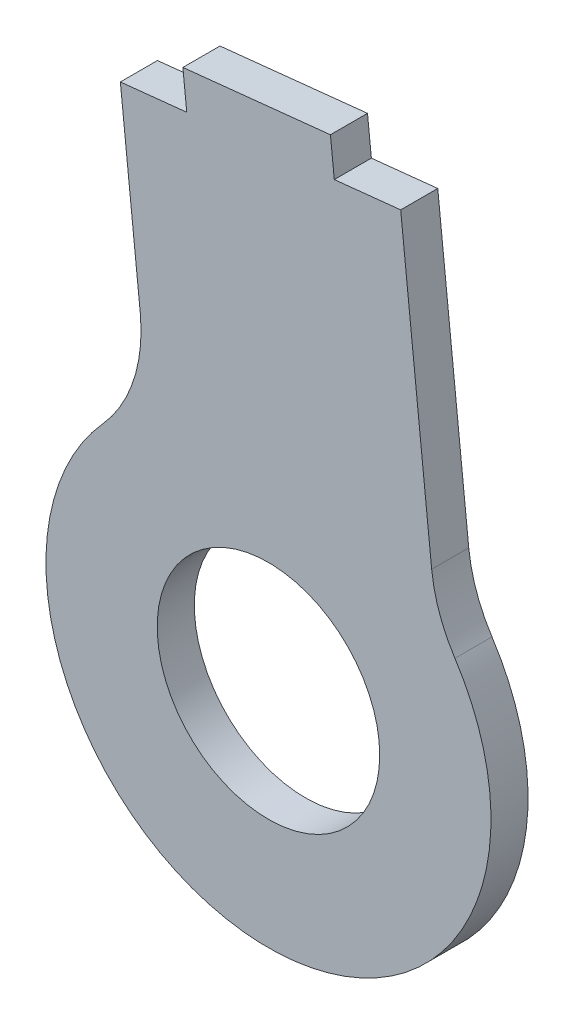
ISO-10303-21;
HEADER;
FILE_DESCRIPTION(('STEP AP214'),'2;1');
FILE_NAME('part.step','',(''),(''),'','','');
FILE_SCHEMA(('AUTOMOTIVE_DESIGN { 1 0 10303 214 1 1 1 1 }'));
ENDSEC;
DATA;
#1=APPLICATION_CONTEXT('core data for automotive mechanical design processes');
#2=APPLICATION_PROTOCOL_DEFINITION('international standard','automotive_design',2000,#1);
#3=PRODUCT_CONTEXT('',#1,'mechanical');
#4=PRODUCT('Part','Part','',(#3));
#5=PRODUCT_RELATED_PRODUCT_CATEGORY('part','',(#4));
#6=PRODUCT_DEFINITION_FORMATION('','',#4);
#7=PRODUCT_DEFINITION_CONTEXT('part definition',#1,'design');
#8=PRODUCT_DEFINITION('design','',#6,#7);
#9=PRODUCT_DEFINITION_SHAPE('','',#8);
#10=(LENGTH_UNIT() NAMED_UNIT(*) SI_UNIT(.MILLI.,.METRE.));
#11=(NAMED_UNIT(*) PLANE_ANGLE_UNIT() SI_UNIT($,.RADIAN.));
#12=(NAMED_UNIT(*) SI_UNIT($,.STERADIAN.) SOLID_ANGLE_UNIT());
#13=UNCERTAINTY_MEASURE_WITH_UNIT(LENGTH_MEASURE(1.E-05),#10,'distance_accuracy_value','');
#14=(GEOMETRIC_REPRESENTATION_CONTEXT(3) GLOBAL_UNCERTAINTY_ASSIGNED_CONTEXT((#13)) GLOBAL_UNIT_ASSIGNED_CONTEXT((#10,
#11,#12)) REPRESENTATION_CONTEXT('',''));
#15=CARTESIAN_POINT('',(0.,0.,0.));
#16=DIRECTION('',(0.,0.,1.));
#17=DIRECTION('',(1.,0.,0.));
#18=AXIS2_PLACEMENT_3D('',#15,#16,#17);
#19=CARTESIAN_POINT('',(42.9472796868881,13.6459324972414,2.5));
#20=DIRECTION('',(0.,0.,1.));
#21=DIRECTION('',(1.,0.,0.));
#22=AXIS2_PLACEMENT_3D('',#19,#20,#21);
#23=PLANE('',#22);
#24=DIRECTION('',(-0.994553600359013,-0.104226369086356,0.));
#25=VECTOR('',#24,1.);
#26=CARTESIAN_POINT('',(16.2310965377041,33.5130367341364,2.5));
#27=LINE('',#26,#25);
#28=CARTESIAN_POINT('',(26.1766325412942,34.555300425,2.5));
#29=VERTEX_POINT('',#28);
#30=CARTESIAN_POINT('',(16.2310965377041,33.5130367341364,2.5));
#31=VERTEX_POINT('',#30);
#32=EDGE_CURVE('E186',#29,#31,#27,.T.);
#33=ORIENTED_EDGE('',*,*,#32,.T.);
#34=DIRECTION('',(0.104226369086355,-0.994553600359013,0.));
#35=VECTOR('',#34,1.);
#36=CARTESIAN_POINT('',(16.49166246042,31.0266527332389,2.5));
#37=LINE('',#36,#35);
#38=CARTESIAN_POINT('',(16.49166246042,31.0266527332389,2.5));
#39=VERTEX_POINT('',#38);
#40=EDGE_CURVE('E110',#31,#39,#37,.T.);
#41=ORIENTED_EDGE('',*,*,#40,.T.);
#42=DIRECTION('',(-0.994553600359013,-0.104226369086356,0.));
#43=VECTOR('',#42,1.);
#44=CARTESIAN_POINT('',(12.0161712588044,30.5576340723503,2.5));
#45=LINE('',#44,#43);
#46=CARTESIAN_POINT('',(12.0161712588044,30.5576340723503,2.5));
#47=VERTEX_POINT('',#46);
#48=EDGE_CURVE('E215',#39,#47,#45,.T.);
#49=ORIENTED_EDGE('',*,*,#48,.T.);
#50=DIRECTION('',(0.104226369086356,-0.994553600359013,0.));
#51=VECTOR('',#50,1.);
#52=CARTESIAN_POINT('',(13.357338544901,17.7598865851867,2.5));
#53=LINE('',#52,#51);
#54=CARTESIAN_POINT('',(13.357338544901,17.7598865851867,2.5));
#55=VERTEX_POINT('',#54);
#56=EDGE_CURVE('E235',#47,#55,#53,.T.);
#57=ORIENTED_EDGE('',*,*,#56,.T.);
#58=CARTESIAN_POINT('',(3.41180254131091,16.7176228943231,2.5));
#59=DIRECTION('',(0.,0.,-1.));
#60=DIRECTION('',(1.,0.,0.));
#61=AXIS2_PLACEMENT_3D('',#58,#59,#60);
#62=CIRCLE('',#61,10.);
#63=CARTESIAN_POINT('',(10.8470815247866,10.0305737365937,2.5));
#64=VERTEX_POINT('',#63);
#65=EDGE_CURVE('E231',#55,#64,#62,.T.);
#66=ORIENTED_EDGE('',*,*,#65,.T.);
#67=CARTESIAN_POINT('',(22.,0.,2.5));
#68=DIRECTION('',(0.,0.,1.));
#69=DIRECTION('',(1.,0.,0.));
#70=AXIS2_PLACEMENT_3D('',#67,#68,#69);
#71=CIRCLE('',#70,15.);
#72=CARTESIAN_POINT('',(34.5683678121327,8.1875594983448,2.5));
#73=VERTEX_POINT('',#72);
#74=EDGE_CURVE('E234',#64,#73,#71,.T.);
#75=ORIENTED_EDGE('',*,*,#74,.T.);
#76=CARTESIAN_POINT('',(42.9472796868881,13.6459324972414,2.5));
#77=DIRECTION('',(0.,0.,-1.));
#78=DIRECTION('',(1.,0.,0.));
#79=AXIS2_PLACEMENT_3D('',#76,#77,#78);
#80=CIRCLE('',#79,10.);
#81=CARTESIAN_POINT('',(33.001743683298,12.6036688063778,2.5));
#82=VERTEX_POINT('',#81);
#83=EDGE_CURVE('E135',#73,#82,#80,.T.);
#84=ORIENTED_EDGE('',*,*,#83,.T.);
#85=DIRECTION('',(-0.104226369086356,0.994553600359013,0.));
#86=VECTOR('',#85,1.);
#87=CARTESIAN_POINT('',(30.9126896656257,32.537935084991,2.5));
#88=LINE('',#87,#86);
#89=CARTESIAN_POINT('',(30.9126896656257,32.537935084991,2.5));
#90=VERTEX_POINT('',#89);
#91=EDGE_CURVE('E129',#82,#90,#88,.T.);
#92=ORIENTED_EDGE('',*,*,#91,.T.);
#93=DIRECTION('',(-0.994553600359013,-0.104226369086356,0.));
#94=VECTOR('',#93,1.);
#95=CARTESIAN_POINT('',(26.4371984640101,32.0689164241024,2.5));
#96=LINE('',#95,#94);
#97=CARTESIAN_POINT('',(26.4371984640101,32.0689164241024,2.5));
#98=VERTEX_POINT('',#97);
#99=EDGE_CURVE('E133',#90,#98,#96,.T.);
#100=ORIENTED_EDGE('',*,*,#99,.T.);
#101=DIRECTION('',(-0.104226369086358,0.994553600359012,0.));
#102=VECTOR('',#101,1.);
#103=CARTESIAN_POINT('',(26.1766325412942,34.555300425,2.5));
#104=LINE('',#103,#102);
#105=EDGE_CURVE('E61',#98,#29,#104,.T.);
#106=ORIENTED_EDGE('',*,*,#105,.T.);
#107=EDGE_LOOP('',(#33,#41,#49,#57,#66,#75,#84,#92,#100,#106));
#108=FACE_BOUND('',#107,.T.);
#109=CARTESIAN_POINT('',(22.,0.,2.5));
#110=DIRECTION('',(0.,0.,1.));
#111=DIRECTION('',(1.,0.,0.));
#112=AXIS2_PLACEMENT_3D('',#109,#110,#111);
#113=CIRCLE('',#112,7.49999999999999);
#114=CARTESIAN_POINT('',(29.5,0.,2.5));
#115=VERTEX_POINT('',#114);
#116=EDGE_CURVE('E162',#115,#115,#113,.T.);
#117=ORIENTED_EDGE('',*,*,#116,.F.);
#118=EDGE_LOOP('',(#117));
#119=FACE_BOUND('',#118,.T.);
#120=ADVANCED_FACE('F43',(#108,#119),#23,.T.);
#121=CARTESIAN_POINT('',(42.9472796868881,13.6459324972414,0.));
#122=DIRECTION('',(0.,0.,1.));
#123=DIRECTION('',(1.,0.,0.));
#124=AXIS2_PLACEMENT_3D('',#121,#122,#123);
#125=PLANE('',#124);
#126=DIRECTION('',(-0.994553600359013,-0.104226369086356,0.));
#127=VECTOR('',#126,1.);
#128=CARTESIAN_POINT('',(16.2310965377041,33.5130367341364,0.));
#129=LINE('',#128,#127);
#130=CARTESIAN_POINT('',(26.1766325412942,34.555300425,0.));
#131=VERTEX_POINT('',#130);
#132=CARTESIAN_POINT('',(16.2310965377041,33.5130367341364,0.));
#133=VERTEX_POINT('',#132);
#134=EDGE_CURVE('E157',#131,#133,#129,.T.);
#135=ORIENTED_EDGE('',*,*,#134,.F.);
#136=DIRECTION('',(-0.104226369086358,0.994553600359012,0.));
#137=VECTOR('',#136,1.);
#138=CARTESIAN_POINT('',(26.1766325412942,34.555300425,0.));
#139=LINE('',#138,#137);
#140=CARTESIAN_POINT('',(26.4371984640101,32.0689164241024,0.));
#141=VERTEX_POINT('',#140);
#142=EDGE_CURVE('E102',#141,#131,#139,.T.);
#143=ORIENTED_EDGE('',*,*,#142,.F.);
#144=DIRECTION('',(-0.994553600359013,-0.104226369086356,0.));
#145=VECTOR('',#144,1.);
#146=CARTESIAN_POINT('',(26.4371984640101,32.0689164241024,0.));
#147=LINE('',#146,#145);
#148=CARTESIAN_POINT('',(30.9126896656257,32.537935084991,0.));
#149=VERTEX_POINT('',#148);
#150=EDGE_CURVE('E96',#149,#141,#147,.T.);
#151=ORIENTED_EDGE('',*,*,#150,.F.);
#152=DIRECTION('',(-0.104226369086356,0.994553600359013,0.));
#153=VECTOR('',#152,1.);
#154=CARTESIAN_POINT('',(30.9126896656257,32.537935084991,0.));
#155=LINE('',#154,#153);
#156=CARTESIAN_POINT('',(33.001743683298,12.6036688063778,0.));
#157=VERTEX_POINT('',#156);
#158=EDGE_CURVE('E144',#157,#149,#155,.T.);
#159=ORIENTED_EDGE('',*,*,#158,.F.);
#160=CARTESIAN_POINT('',(42.9472796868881,13.6459324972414,0.));
#161=DIRECTION('',(0.,0.,-1.));
#162=DIRECTION('',(1.,0.,0.));
#163=AXIS2_PLACEMENT_3D('',#160,#161,#162);
#164=CIRCLE('',#163,10.);
#165=CARTESIAN_POINT('',(34.5683678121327,8.1875594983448,0.));
#166=VERTEX_POINT('',#165);
#167=EDGE_CURVE('E177',#166,#157,#164,.T.);
#168=ORIENTED_EDGE('',*,*,#167,.F.);
#169=CARTESIAN_POINT('',(22.,0.,0.));
#170=DIRECTION('',(0.,0.,1.));
#171=DIRECTION('',(1.,0.,0.));
#172=AXIS2_PLACEMENT_3D('',#169,#170,#171);
#173=CIRCLE('',#172,15.);
#174=CARTESIAN_POINT('',(10.8470815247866,10.0305737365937,0.));
#175=VERTEX_POINT('',#174);
#176=EDGE_CURVE('E174',#175,#166,#173,.T.);
#177=ORIENTED_EDGE('',*,*,#176,.F.);
#178=CARTESIAN_POINT('',(3.41180254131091,16.7176228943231,0.));
#179=DIRECTION('',(0.,0.,-1.));
#180=DIRECTION('',(1.,0.,0.));
#181=AXIS2_PLACEMENT_3D('',#178,#179,#180);
#182=CIRCLE('',#181,10.);
#183=CARTESIAN_POINT('',(13.357338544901,17.7598865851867,0.));
#184=VERTEX_POINT('',#183);
#185=EDGE_CURVE('E171',#184,#175,#182,.T.);
#186=ORIENTED_EDGE('',*,*,#185,.F.);
#187=DIRECTION('',(0.104226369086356,-0.994553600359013,0.));
#188=VECTOR('',#187,1.);
#189=CARTESIAN_POINT('',(13.357338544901,17.7598865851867,0.));
#190=LINE('',#189,#188);
#191=CARTESIAN_POINT('',(12.0161712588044,30.5576340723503,0.));
#192=VERTEX_POINT('',#191);
#193=EDGE_CURVE('E168',#192,#184,#190,.T.);
#194=ORIENTED_EDGE('',*,*,#193,.F.);
#195=DIRECTION('',(-0.994553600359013,-0.104226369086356,0.));
#196=VECTOR('',#195,1.);
#197=CARTESIAN_POINT('',(12.0161712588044,30.5576340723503,0.));
#198=LINE('',#197,#196);
#199=CARTESIAN_POINT('',(16.49166246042,31.0266527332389,0.));
#200=VERTEX_POINT('',#199);
#201=EDGE_CURVE('E165',#200,#192,#198,.T.);
#202=ORIENTED_EDGE('',*,*,#201,.F.);
#203=DIRECTION('',(0.104226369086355,-0.994553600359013,0.));
#204=VECTOR('',#203,1.);
#205=CARTESIAN_POINT('',(16.49166246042,31.0266527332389,0.));
#206=LINE('',#205,#204);
#207=EDGE_CURVE('E161',#133,#200,#206,.T.);
#208=ORIENTED_EDGE('',*,*,#207,.F.);
#209=EDGE_LOOP('',(#135,#143,#151,#159,#168,#177,#186,#194,#202,#208));
#210=FACE_BOUND('',#209,.T.);
#211=CARTESIAN_POINT('',(22.,0.,0.));
#212=DIRECTION('',(0.,0.,1.));
#213=DIRECTION('',(1.,0.,0.));
#214=AXIS2_PLACEMENT_3D('',#211,#212,#213);
#215=CIRCLE('',#214,7.49999999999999);
#216=CARTESIAN_POINT('',(29.5,0.,0.));
#217=VERTEX_POINT('',#216);
#218=EDGE_CURVE('E249',#217,#217,#215,.T.);
#219=ORIENTED_EDGE('',*,*,#218,.T.);
#220=EDGE_LOOP('',(#219));
#221=FACE_BOUND('',#220,.T.);
#222=ADVANCED_FACE('F219',(#210,#221),#125,.F.);
#223=CARTESIAN_POINT('',(16.2310965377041,33.5130367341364,2.5));
#224=DIRECTION('',(0.104226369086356,-0.994553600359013,0.));
#225=DIRECTION('',(0.994553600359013,0.104226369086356,0.));
#226=AXIS2_PLACEMENT_3D('',#223,#224,#225);
#227=PLANE('',#226);
#228=ORIENTED_EDGE('',*,*,#134,.T.);
#229=DIRECTION('',(0.,0.,-1.));
#230=VECTOR('',#229,1.);
#231=CARTESIAN_POINT('',(16.2310965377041,33.5130367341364,2.5));
#232=LINE('',#231,#230);
#233=EDGE_CURVE('E11',#31,#133,#232,.T.);
#234=ORIENTED_EDGE('',*,*,#233,.F.);
#235=ORIENTED_EDGE('',*,*,#32,.F.);
#236=DIRECTION('',(0.,0.,-1.));
#237=VECTOR('',#236,1.);
#238=CARTESIAN_POINT('',(26.1766325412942,34.555300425,2.5));
#239=LINE('',#238,#237);
#240=EDGE_CURVE('E153',#29,#131,#239,.T.);
#241=ORIENTED_EDGE('',*,*,#240,.T.);
#242=EDGE_LOOP('',(#228,#234,#235,#241));
#243=FACE_BOUND('',#242,.T.);
#244=ADVANCED_FACE('F45',(#243),#227,.F.);
#245=CARTESIAN_POINT('',(16.49166246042,31.0266527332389,2.5));
#246=DIRECTION('',(0.994553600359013,0.104226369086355,0.));
#247=DIRECTION('',(-0.104226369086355,0.994553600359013,0.));
#248=AXIS2_PLACEMENT_3D('',#245,#246,#247);
#249=PLANE('',#248);
#250=ORIENTED_EDGE('',*,*,#207,.T.);
#251=DIRECTION('',(0.,0.,-1.));
#252=VECTOR('',#251,1.);
#253=CARTESIAN_POINT('',(16.49166246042,31.0266527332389,2.5));
#254=LINE('',#253,#252);
#255=EDGE_CURVE('E53',#39,#200,#254,.T.);
#256=ORIENTED_EDGE('',*,*,#255,.F.);
#257=ORIENTED_EDGE('',*,*,#40,.F.);
#258=ORIENTED_EDGE('',*,*,#233,.T.);
#259=EDGE_LOOP('',(#250,#256,#257,#258));
#260=FACE_BOUND('',#259,.T.);
#261=ADVANCED_FACE('F287',(#260),#249,.F.);
#262=CARTESIAN_POINT('',(12.0161712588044,30.5576340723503,2.5));
#263=DIRECTION('',(0.104226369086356,-0.994553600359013,0.));
#264=DIRECTION('',(0.994553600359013,0.104226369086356,0.));
#265=AXIS2_PLACEMENT_3D('',#262,#263,#264);
#266=PLANE('',#265);
#267=ORIENTED_EDGE('',*,*,#201,.T.);
#268=DIRECTION('',(0.,0.,-1.));
#269=VECTOR('',#268,1.);
#270=CARTESIAN_POINT('',(12.0161712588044,30.5576340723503,2.5));
#271=LINE('',#270,#269);
#272=EDGE_CURVE('E205',#47,#192,#271,.T.);
#273=ORIENTED_EDGE('',*,*,#272,.F.);
#274=ORIENTED_EDGE('',*,*,#48,.F.);
#275=ORIENTED_EDGE('',*,*,#255,.T.);
#276=EDGE_LOOP('',(#267,#273,#274,#275));
#277=FACE_BOUND('',#276,.T.);
#278=ADVANCED_FACE('F213',(#277),#266,.F.);
#279=CARTESIAN_POINT('',(13.357338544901,17.7598865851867,2.5));
#280=DIRECTION('',(0.994553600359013,0.104226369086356,0.));
#281=DIRECTION('',(-0.104226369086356,0.994553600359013,0.));
#282=AXIS2_PLACEMENT_3D('',#279,#280,#281);
#283=PLANE('',#282);
#284=ORIENTED_EDGE('',*,*,#193,.T.);
#285=DIRECTION('',(0.,0.,-1.));
#286=VECTOR('',#285,1.);
#287=CARTESIAN_POINT('',(13.357338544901,17.7598865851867,2.5));
#288=LINE('',#287,#286);
#289=EDGE_CURVE('E201',#55,#184,#288,.T.);
#290=ORIENTED_EDGE('',*,*,#289,.F.);
#291=ORIENTED_EDGE('',*,*,#56,.F.);
#292=ORIENTED_EDGE('',*,*,#272,.T.);
#293=EDGE_LOOP('',(#284,#290,#291,#292));
#294=FACE_BOUND('',#293,.T.);
#295=ADVANCED_FACE('F225',(#294),#283,.F.);
#296=CARTESIAN_POINT('',(3.41180254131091,16.7176228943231,2.5));
#297=DIRECTION('',(0.,0.,-1.));
#298=DIRECTION('',(-1.,0.,0.));
#299=AXIS2_PLACEMENT_3D('',#296,#297,#298);
#300=CYLINDRICAL_SURFACE('',#299,10.);
#301=ORIENTED_EDGE('',*,*,#185,.T.);
#302=DIRECTION('',(0.,0.,-1.));
#303=VECTOR('',#302,1.);
#304=CARTESIAN_POINT('',(10.8470815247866,10.0305737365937,2.5));
#305=LINE('',#304,#303);
#306=EDGE_CURVE('E197',#64,#175,#305,.T.);
#307=ORIENTED_EDGE('',*,*,#306,.F.);
#308=ORIENTED_EDGE('',*,*,#65,.F.);
#309=ORIENTED_EDGE('',*,*,#289,.T.);
#310=EDGE_LOOP('',(#301,#307,#308,#309));
#311=FACE_BOUND('',#310,.T.);
#312=ADVANCED_FACE('F229',(#311),#300,.F.);
#313=CARTESIAN_POINT('',(22.,0.,2.5));
#314=DIRECTION('',(0.,0.,-1.));
#315=DIRECTION('',(-1.,0.,0.));
#316=AXIS2_PLACEMENT_3D('',#313,#314,#315);
#317=CYLINDRICAL_SURFACE('',#316,15.);
#318=ORIENTED_EDGE('',*,*,#176,.T.);
#319=DIRECTION('',(0.,0.,-1.));
#320=VECTOR('',#319,1.);
#321=CARTESIAN_POINT('',(34.5683678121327,8.1875594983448,2.5));
#322=LINE('',#321,#320);
#323=EDGE_CURVE('E193',#73,#166,#322,.T.);
#324=ORIENTED_EDGE('',*,*,#323,.F.);
#325=ORIENTED_EDGE('',*,*,#74,.F.);
#326=ORIENTED_EDGE('',*,*,#306,.T.);
#327=EDGE_LOOP('',(#318,#324,#325,#326));
#328=FACE_BOUND('',#327,.T.);
#329=ADVANCED_FACE('F277',(#328),#317,.T.);
#330=CARTESIAN_POINT('',(42.9472796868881,13.6459324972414,2.5));
#331=DIRECTION('',(0.,0.,-1.));
#332=DIRECTION('',(-1.,0.,0.));
#333=AXIS2_PLACEMENT_3D('',#330,#331,#332);
#334=CYLINDRICAL_SURFACE('',#333,10.);
#335=ORIENTED_EDGE('',*,*,#167,.T.);
#336=DIRECTION('',(0.,0.,-1.));
#337=VECTOR('',#336,1.);
#338=CARTESIAN_POINT('',(33.001743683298,12.6036688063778,2.5));
#339=LINE('',#338,#337);
#340=EDGE_CURVE('E146',#82,#157,#339,.T.);
#341=ORIENTED_EDGE('',*,*,#340,.F.);
#342=ORIENTED_EDGE('',*,*,#83,.F.);
#343=ORIENTED_EDGE('',*,*,#323,.T.);
#344=EDGE_LOOP('',(#335,#341,#342,#343));
#345=FACE_BOUND('',#344,.T.);
#346=ADVANCED_FACE('F274',(#345),#334,.F.);
#347=CARTESIAN_POINT('',(30.9126896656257,32.537935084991,2.5));
#348=DIRECTION('',(-0.994553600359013,-0.104226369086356,0.));
#349=DIRECTION('',(0.104226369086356,-0.994553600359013,0.));
#350=AXIS2_PLACEMENT_3D('',#347,#348,#349);
#351=PLANE('',#350);
#352=ORIENTED_EDGE('',*,*,#158,.T.);
#353=DIRECTION('',(0.,0.,-1.));
#354=VECTOR('',#353,1.);
#355=CARTESIAN_POINT('',(30.9126896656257,32.537935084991,2.5));
#356=LINE('',#355,#354);
#357=EDGE_CURVE('E141',#90,#149,#356,.T.);
#358=ORIENTED_EDGE('',*,*,#357,.F.);
#359=ORIENTED_EDGE('',*,*,#91,.F.);
#360=ORIENTED_EDGE('',*,*,#340,.T.);
#361=EDGE_LOOP('',(#352,#358,#359,#360));
#362=FACE_BOUND('',#361,.T.);
#363=ADVANCED_FACE('F142',(#362),#351,.F.);
#364=CARTESIAN_POINT('',(26.4371984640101,32.0689164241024,2.5));
#365=DIRECTION('',(0.104226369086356,-0.994553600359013,0.));
#366=DIRECTION('',(0.994553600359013,0.104226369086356,0.));
#367=AXIS2_PLACEMENT_3D('',#364,#365,#366);
#368=PLANE('',#367);
#369=ORIENTED_EDGE('',*,*,#150,.T.);
#370=DIRECTION('',(0.,0.,-1.));
#371=VECTOR('',#370,1.);
#372=CARTESIAN_POINT('',(26.4371984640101,32.0689164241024,2.5));
#373=LINE('',#372,#371);
#374=EDGE_CURVE('E147',#98,#141,#373,.T.);
#375=ORIENTED_EDGE('',*,*,#374,.F.);
#376=ORIENTED_EDGE('',*,*,#99,.F.);
#377=ORIENTED_EDGE('',*,*,#357,.T.);
#378=EDGE_LOOP('',(#369,#375,#376,#377));
#379=FACE_BOUND('',#378,.T.);
#380=ADVANCED_FACE('F149',(#379),#368,.F.);
#381=CARTESIAN_POINT('',(26.1766325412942,34.555300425,2.5));
#382=DIRECTION('',(-0.994553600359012,-0.104226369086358,0.));
#383=DIRECTION('',(0.104226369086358,-0.994553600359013,0.));
#384=AXIS2_PLACEMENT_3D('',#381,#382,#383);
#385=PLANE('',#384);
#386=ORIENTED_EDGE('',*,*,#142,.T.);
#387=ORIENTED_EDGE('',*,*,#240,.F.);
#388=ORIENTED_EDGE('',*,*,#105,.F.);
#389=ORIENTED_EDGE('',*,*,#374,.T.);
#390=EDGE_LOOP('',(#386,#387,#388,#389));
#391=FACE_BOUND('',#390,.T.);
#392=ADVANCED_FACE('F267',(#391),#385,.F.);
#393=CARTESIAN_POINT('',(22.,0.,2.5));
#394=DIRECTION('',(0.,0.,-1.));
#395=DIRECTION('',(-1.,0.,0.));
#396=AXIS2_PLACEMENT_3D('',#393,#394,#395);
#397=CYLINDRICAL_SURFACE('',#396,7.49999999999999);
#398=ORIENTED_EDGE('',*,*,#116,.T.);
#399=EDGE_LOOP('',(#398));
#400=FACE_BOUND('',#399,.T.);
#401=ORIENTED_EDGE('',*,*,#218,.F.);
#402=EDGE_LOOP('',(#401));
#403=FACE_BOUND('',#402,.T.);
#404=ADVANCED_FACE('F257',(#400,#403),#397,.F.);
#405=CLOSED_SHELL('',(#120,#222,#244,#261,#278,#295,#312,#329,#346,#363,#380,#392,#404));
#406=MANIFOLD_SOLID_BREP('B2',#405);
#407=ADVANCED_BREP_SHAPE_REPRESENTATION('',(#18,#406),#14);
#408=SHAPE_DEFINITION_REPRESENTATION(#9,#407);
ENDSEC;
END-ISO-10303-21;
